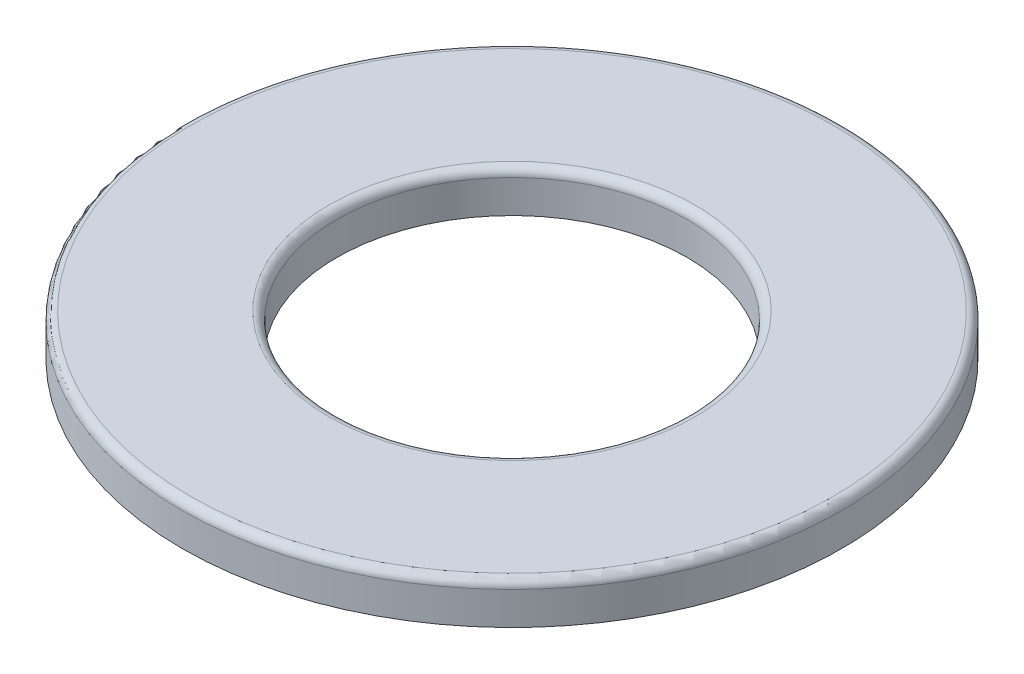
ISO-10303-21;
HEADER;
FILE_DESCRIPTION(('STEP AP214'),'2;1');
FILE_NAME('part.step','',(''),(''),'','','');
FILE_SCHEMA(('AUTOMOTIVE_DESIGN { 1 0 10303 214 1 1 1 1 }'));
ENDSEC;
DATA;
#1=APPLICATION_CONTEXT('core data for automotive mechanical design processes');
#2=APPLICATION_PROTOCOL_DEFINITION('international standard','automotive_design',2000,#1);
#3=PRODUCT_CONTEXT('',#1,'mechanical');
#4=PRODUCT('Part','Part','',(#3));
#5=PRODUCT_RELATED_PRODUCT_CATEGORY('part','',(#4));
#6=PRODUCT_DEFINITION_FORMATION('','',#4);
#7=PRODUCT_DEFINITION_CONTEXT('part definition',#1,'design');
#8=PRODUCT_DEFINITION('design','',#6,#7);
#9=PRODUCT_DEFINITION_SHAPE('','',#8);
#10=(LENGTH_UNIT() NAMED_UNIT(*) SI_UNIT(.MILLI.,.METRE.));
#11=(NAMED_UNIT(*) PLANE_ANGLE_UNIT() SI_UNIT($,.RADIAN.));
#12=(NAMED_UNIT(*) SI_UNIT($,.STERADIAN.) SOLID_ANGLE_UNIT());
#13=UNCERTAINTY_MEASURE_WITH_UNIT(LENGTH_MEASURE(1.E-05),#10,'distance_accuracy_value','');
#14=(GEOMETRIC_REPRESENTATION_CONTEXT(3) GLOBAL_UNCERTAINTY_ASSIGNED_CONTEXT((#13)) GLOBAL_UNIT_ASSIGNED_CONTEXT((#10,
#11,#12)) REPRESENTATION_CONTEXT('',''));
#15=CARTESIAN_POINT('',(0.,0.,0.));
#16=DIRECTION('',(0.,0.,1.));
#17=DIRECTION('',(1.,0.,0.));
#18=AXIS2_PLACEMENT_3D('',#15,#16,#17);
#19=CARTESIAN_POINT('',(0.,0.5,0.));
#20=DIRECTION('',(0.,1.,0.));
#21=DIRECTION('',(0.,0.,1.));
#22=AXIS2_PLACEMENT_3D('',#19,#20,#21);
#23=PLANE('',#22);
#24=CARTESIAN_POINT('',(0.,0.5,0.));
#25=DIRECTION('',(0.,1.,0.));
#26=DIRECTION('',(0.,0.,1.));
#27=AXIS2_PLACEMENT_3D('',#24,#25,#26);
#28=CIRCLE('',#27,7.8);
#29=CARTESIAN_POINT('',(0.,0.5,7.8));
#30=VERTEX_POINT('',#29);
#31=EDGE_CURVE('E46',#30,#30,#28,.T.);
#32=ORIENTED_EDGE('',*,*,#31,.T.);
#33=EDGE_LOOP('',(#32));
#34=FACE_BOUND('',#33,.T.);
#35=CARTESIAN_POINT('',(0.,0.5,0.));
#36=DIRECTION('',(0.,1.,0.));
#37=DIRECTION('',(0.,0.,1.));
#38=AXIS2_PLACEMENT_3D('',#35,#36,#37);
#39=CIRCLE('',#38,4.45);
#40=CARTESIAN_POINT('',(0.,0.5,4.45));
#41=VERTEX_POINT('',#40);
#42=EDGE_CURVE('E50',#41,#41,#39,.F.);
#43=ORIENTED_EDGE('',*,*,#42,.T.);
#44=EDGE_LOOP('',(#43));
#45=FACE_BOUND('',#44,.T.);
#46=ADVANCED_FACE('F35',(#34,#45),#23,.T.);
#47=CARTESIAN_POINT('',(0.,-0.5,0.));
#48=DIRECTION('',(0.,1.,0.));
#49=DIRECTION('',(0.,0.,1.));
#50=AXIS2_PLACEMENT_3D('',#47,#48,#49);
#51=PLANE('',#50);
#52=CARTESIAN_POINT('',(0.,-0.5,0.));
#53=DIRECTION('',(0.,1.,0.));
#54=DIRECTION('',(0.,0.,1.));
#55=AXIS2_PLACEMENT_3D('',#52,#53,#54);
#56=CIRCLE('',#55,8.);
#57=CARTESIAN_POINT('',(0.,-0.5,8.));
#58=VERTEX_POINT('',#57);
#59=EDGE_CURVE('E55',#58,#58,#56,.T.);
#60=ORIENTED_EDGE('',*,*,#59,.F.);
#61=EDGE_LOOP('',(#60));
#62=FACE_BOUND('',#61,.T.);
#63=CARTESIAN_POINT('',(0.,-0.5,0.));
#64=DIRECTION('',(0.,1.,0.));
#65=DIRECTION('',(0.,0.,1.));
#66=AXIS2_PLACEMENT_3D('',#63,#64,#65);
#67=CIRCLE('',#66,4.25);
#68=CARTESIAN_POINT('',(0.,-0.5,4.25));
#69=VERTEX_POINT('',#68);
#70=EDGE_CURVE('E58',#69,#69,#67,.T.);
#71=ORIENTED_EDGE('',*,*,#70,.T.);
#72=EDGE_LOOP('',(#71));
#73=FACE_BOUND('',#72,.T.);
#74=ADVANCED_FACE('F62',(#62,#73),#51,.F.);
#75=CARTESIAN_POINT('',(0.,0.5,0.));
#76=DIRECTION('',(0.,-1.,0.));
#77=DIRECTION('',(0.,0.,-1.));
#78=AXIS2_PLACEMENT_3D('',#75,#76,#77);
#79=CYLINDRICAL_SURFACE('',#78,8.);
#80=CARTESIAN_POINT('',(0.,0.3,0.));
#81=DIRECTION('',(0.,1.,0.));
#82=DIRECTION('',(0.,0.,1.));
#83=AXIS2_PLACEMENT_3D('',#80,#81,#82);
#84=CIRCLE('',#83,8.);
#85=CARTESIAN_POINT('',(0.,0.3,8.));
#86=VERTEX_POINT('',#85);
#87=EDGE_CURVE('E42',#86,#86,#84,.F.);
#88=ORIENTED_EDGE('',*,*,#87,.T.);
#89=EDGE_LOOP('',(#88));
#90=FACE_BOUND('',#89,.T.);
#91=ORIENTED_EDGE('',*,*,#59,.T.);
#92=EDGE_LOOP('',(#91));
#93=FACE_BOUND('',#92,.T.);
#94=ADVANCED_FACE('F67',(#90,#93),#79,.T.);
#95=CARTESIAN_POINT('',(0.,0.5,0.));
#96=DIRECTION('',(0.,-1.,0.));
#97=DIRECTION('',(0.,0.,-1.));
#98=AXIS2_PLACEMENT_3D('',#95,#96,#97);
#99=CYLINDRICAL_SURFACE('',#98,4.25);
#100=CARTESIAN_POINT('',(0.,0.3,0.));
#101=DIRECTION('',(0.,1.,0.));
#102=DIRECTION('',(0.,0.,1.));
#103=AXIS2_PLACEMENT_3D('',#100,#101,#102);
#104=CIRCLE('',#103,4.25);
#105=CARTESIAN_POINT('',(0.,0.3,4.25));
#106=VERTEX_POINT('',#105);
#107=EDGE_CURVE('E10',#106,#106,#104,.T.);
#108=ORIENTED_EDGE('',*,*,#107,.T.);
#109=EDGE_LOOP('',(#108));
#110=FACE_BOUND('',#109,.T.);
#111=ORIENTED_EDGE('',*,*,#70,.F.);
#112=EDGE_LOOP('',(#111));
#113=FACE_BOUND('',#112,.T.);
#114=ADVANCED_FACE('F64',(#110,#113),#99,.F.);
#115=CARTESIAN_POINT('',(0.,0.3,0.));
#116=DIRECTION('',(0.,1.,0.));
#117=DIRECTION('',(0.,0.,1.));
#118=AXIS2_PLACEMENT_3D('',#115,#116,#117);
#119=TOROIDAL_SURFACE('',#118,7.8,0.2);
#120=ORIENTED_EDGE('',*,*,#87,.F.);
#121=EDGE_LOOP('',(#120));
#122=FACE_BOUND('',#121,.T.);
#123=ORIENTED_EDGE('',*,*,#31,.F.);
#124=EDGE_LOOP('',(#123));
#125=FACE_BOUND('',#124,.T.);
#126=ADVANCED_FACE('F66',(#122,#125),#119,.T.);
#127=CARTESIAN_POINT('',(0.,0.3,0.));
#128=DIRECTION('',(0.,1.,0.));
#129=DIRECTION('',(0.,0.,1.));
#130=AXIS2_PLACEMENT_3D('',#127,#128,#129);
#131=TOROIDAL_SURFACE('',#130,4.45,0.2);
#132=ORIENTED_EDGE('',*,*,#42,.F.);
#133=EDGE_LOOP('',(#132));
#134=FACE_BOUND('',#133,.T.);
#135=ORIENTED_EDGE('',*,*,#107,.F.);
#136=EDGE_LOOP('',(#135));
#137=FACE_BOUND('',#136,.T.);
#138=ADVANCED_FACE('F37',(#134,#137),#131,.T.);
#139=CLOSED_SHELL('',(#46,#74,#94,#114,#126,#138));
#140=MANIFOLD_SOLID_BREP('B2',#139);
#141=ADVANCED_BREP_SHAPE_REPRESENTATION('',(#18,#140),#14);
#142=SHAPE_DEFINITION_REPRESENTATION(#9,#141);
ENDSEC;
END-ISO-10303-21;
